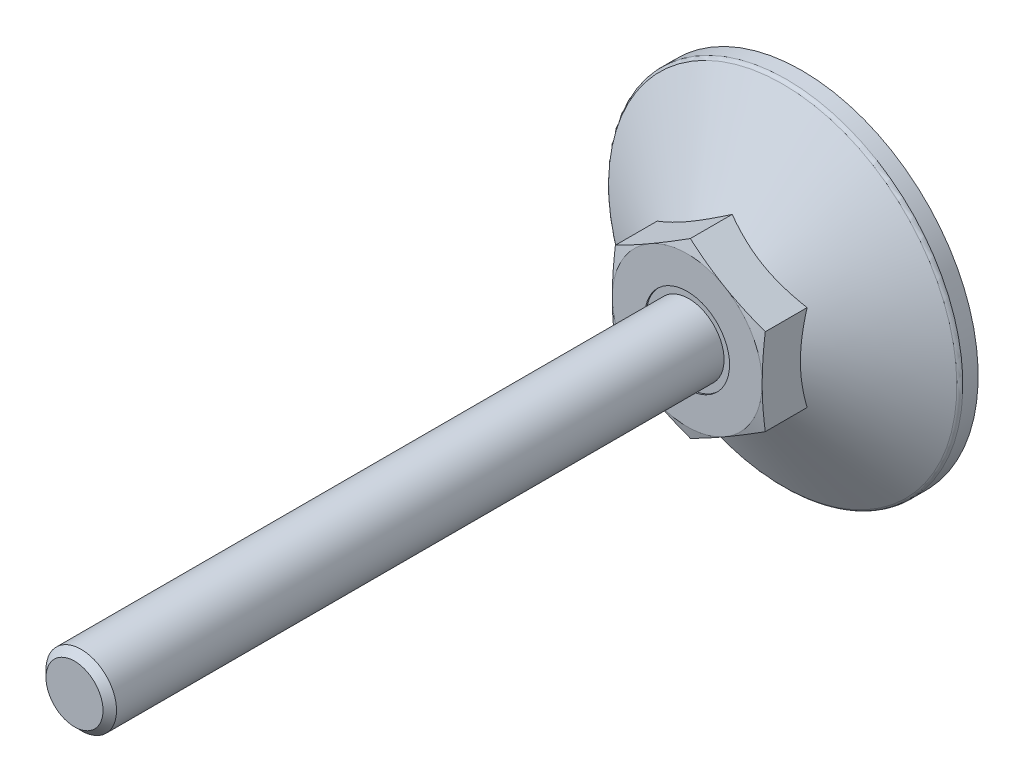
ISO-10303-21;
HEADER;
FILE_DESCRIPTION(('STEP AP214'),'2;1');
FILE_NAME('part.step','',(''),(''),'','','');
FILE_SCHEMA(('AUTOMOTIVE_DESIGN { 1 0 10303 214 1 1 1 1 }'));
ENDSEC;
DATA;
#1=APPLICATION_CONTEXT('core data for automotive mechanical design processes');
#2=APPLICATION_PROTOCOL_DEFINITION('international standard','automotive_design',2000,#1);
#3=PRODUCT_CONTEXT('',#1,'mechanical');
#4=PRODUCT('Part','Part','',(#3));
#5=PRODUCT_RELATED_PRODUCT_CATEGORY('part','',(#4));
#6=PRODUCT_DEFINITION_FORMATION('','',#4);
#7=PRODUCT_DEFINITION_CONTEXT('part definition',#1,'design');
#8=PRODUCT_DEFINITION('design','',#6,#7);
#9=PRODUCT_DEFINITION_SHAPE('','',#8);
#10=(LENGTH_UNIT() NAMED_UNIT(*) SI_UNIT(.MILLI.,.METRE.));
#11=(NAMED_UNIT(*) PLANE_ANGLE_UNIT() SI_UNIT($,.RADIAN.));
#12=(NAMED_UNIT(*) SI_UNIT($,.STERADIAN.) SOLID_ANGLE_UNIT());
#13=UNCERTAINTY_MEASURE_WITH_UNIT(LENGTH_MEASURE(1.E-05),#10,'distance_accuracy_value','');
#14=(GEOMETRIC_REPRESENTATION_CONTEXT(3) GLOBAL_UNCERTAINTY_ASSIGNED_CONTEXT((#13)) GLOBAL_UNIT_ASSIGNED_CONTEXT((#10,
#11,#12)) REPRESENTATION_CONTEXT('',''));
#15=CARTESIAN_POINT('',(0.,0.,0.));
#16=DIRECTION('',(0.,0.,1.));
#17=DIRECTION('',(1.,0.,0.));
#18=AXIS2_PLACEMENT_3D('',#15,#16,#17);
#19=CARTESIAN_POINT('',(0.,9.8149545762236,27.));
#20=DIRECTION('',(0.5,-0.86602540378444,0.));
#21=DIRECTION('',(0.86602540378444,0.5,0.));
#22=AXIS2_PLACEMENT_3D('',#19,#20,#21);
#23=PLANE('',#22);
#24=CARTESIAN_POINT('',(0.0002,9.81507004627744,12.6476280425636));
#25=CARTESIAN_POINT('',(-0.352800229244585,9.61126526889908,12.7022599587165));
#26=CARTESIAN_POINT('',(-0.706440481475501,9.40709097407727,12.7518566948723));
#27=CARTESIAN_POINT('',(-1.41496987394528,8.99802133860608,12.8389934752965));
#28=CARTESIAN_POINT('',(-1.76985946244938,8.79312573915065,12.8765286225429));
#29=CARTESIAN_POINT('',(-2.47873586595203,8.38385575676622,12.9373509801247));
#30=CARTESIAN_POINT('',(-2.83271788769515,8.17948414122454,12.9607107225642));
#31=CARTESIAN_POINT('',(-3.5411333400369,7.77048028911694,12.9920337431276));
#32=CARTESIAN_POINT('',(-3.89556667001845,7.56584811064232,13.));
#33=CARTESIAN_POINT('',(-4.60443332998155,7.15658375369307,13.));
#34=CARTESIAN_POINT('',(-4.9588666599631,6.95195157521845,12.9920337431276));
#35=CARTESIAN_POINT('',(-5.66728211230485,6.54294772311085,12.9607107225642));
#36=CARTESIAN_POINT('',(-6.02126413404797,6.33857610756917,12.9373509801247));
#37=CARTESIAN_POINT('',(-6.73014053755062,5.92930612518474,12.8765286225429));
#38=CARTESIAN_POINT('',(-7.08503012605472,5.7244105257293,12.8389934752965));
#39=CARTESIAN_POINT('',(-7.7935595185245,5.31534089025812,12.7518566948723));
#40=CARTESIAN_POINT('',(-8.14719977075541,5.11116659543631,12.7022599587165));
#41=CARTESIAN_POINT('',(-8.5002,4.90736181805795,12.6476280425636));
#42=B_SPLINE_CURVE_WITH_KNOTS('',3,(#24,#25,#26,#27,#28,#29,#30,#31,#32,#33,#34,#35,#36,#37,#38,
#39,#40,#41),.UNSPECIFIED.,.F.,.F.,(4,2,2,2,2,2,2,2,4),(0.,1.23382789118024,2.46815608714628,
3.69611406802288,4.92383440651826,6.15155474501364,7.37951272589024,8.61384092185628,
9.84766881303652),.UNSPECIFIED.);
#43=CARTESIAN_POINT('',(0.,9.8149545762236,12.6476589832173));
#44=VERTEX_POINT('',#43);
#45=CARTESIAN_POINT('',(-4.25,7.36121593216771,13.));
#46=VERTEX_POINT('',#45);
#47=EDGE_CURVE('E269',#44,#46,#42,.T.);
#48=ORIENTED_EDGE('',*,*,#47,.F.);
#49=DIRECTION('',(0.,0.,-1.));
#50=VECTOR('',#49,1.);
#51=CARTESIAN_POINT('',(0.,9.8149545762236,27.));
#52=LINE('',#51,#50);
#53=CARTESIAN_POINT('',(0.,9.8149545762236,7.90533871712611));
#54=VERTEX_POINT('',#53);
#55=EDGE_CURVE('E43',#44,#54,#52,.T.);
#56=ORIENTED_EDGE('',*,*,#55,.T.);
#57=CARTESIAN_POINT('',(-8.5002,4.90736181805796,7.90527204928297));
#58=CARTESIAN_POINT('',(-8.31336077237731,5.0152334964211,7.96754195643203));
#59=CARTESIAN_POINT('',(-8.1258249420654,5.12350735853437,8.02698579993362));
#60=CARTESIAN_POINT('',(-7.74923024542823,5.34093440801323,8.13944298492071));
#61=CARTESIAN_POINT('',(-7.56017075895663,5.45008795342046,8.19245355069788));
#62=CARTESIAN_POINT('',(-6.98996524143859,5.77929626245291,8.34079470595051));
#63=CARTESIAN_POINT('',(-6.60656835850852,6.00065055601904,8.42516916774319));
#64=CARTESIAN_POINT('',(-6.03282233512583,6.33190297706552,8.52410807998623));
#65=CARTESIAN_POINT('',(-5.8441872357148,6.44081150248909,8.55229289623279));
#66=CARTESIAN_POINT('',(-5.46606397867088,6.65912106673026,8.59955401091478));
#67=CARTESIAN_POINT('',(-5.27657589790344,6.76852206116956,8.61863111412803));
#68=CARTESIAN_POINT('',(-4.89727347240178,6.98751241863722,8.64719332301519));
#69=CARTESIAN_POINT('',(-4.70745974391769,7.0971014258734,8.65668931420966));
#70=CARTESIAN_POINT('',(-4.3276569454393,7.31638067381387,8.66588571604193));
#71=CARTESIAN_POINT('',(-4.13766788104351,7.42607091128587,8.66558642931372));
#72=CARTESIAN_POINT('',(-3.78247698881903,7.63114046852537,8.65587362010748));
#73=CARTESIAN_POINT('',(-3.61725009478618,7.7265342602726,8.64764492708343));
#74=CARTESIAN_POINT('',(-3.28718328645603,7.91709842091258,8.62393885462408));
#75=CARTESIAN_POINT('',(-3.12234339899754,8.01226877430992,8.60846098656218));
#76=CARTESIAN_POINT('',(-2.62846189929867,8.29741139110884,8.55151947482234));
#77=CARTESIAN_POINT('',(-2.30029449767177,8.48687892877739,8.49955503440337));
#78=CARTESIAN_POINT('',(-1.64047857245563,8.86782383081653,8.36964315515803));
#79=CARTESIAN_POINT('',(-1.30891425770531,9.0592525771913,8.29114502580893));
#80=CARTESIAN_POINT('',(-0.650730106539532,9.43925537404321,8.11298675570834));
#81=CARTESIAN_POINT('',(-0.324101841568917,9.62783429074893,8.01336845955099));
#82=CARTESIAN_POINT('',(0.000199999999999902,9.81507004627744,7.90527204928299));
#83=B_SPLINE_CURVE_WITH_KNOTS('',3,(#57,#58,#59,#60,#61,#62,#63,#64,#65,#66,#67,#68,#69,#70,#71,
#72,#73,#74,#75,#76,#77,#78,#79,#80,#81,#82),.UNSPECIFIED.,.F.,.F.,(4,2,2,2,2,2,2,2,2,2,2,2,4),
(0.,0.673596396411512,1.34748239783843,2.69805431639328,3.35679995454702,4.01548737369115,
4.67342558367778,5.33134346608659,5.90409556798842,6.47688628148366,7.62328361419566,
8.79510569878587,9.96462743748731),.UNSPECIFIED.);
#84=CARTESIAN_POINT('',(-8.5,4.9074772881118,7.90533871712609));
#85=VERTEX_POINT('',#84);
#86=EDGE_CURVE('E237',#85,#54,#83,.T.);
#87=ORIENTED_EDGE('',*,*,#86,.F.);
#88=DIRECTION('',(0.,0.,-1.));
#89=VECTOR('',#88,1.);
#90=CARTESIAN_POINT('',(-8.5,4.9074772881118,27.));
#91=LINE('',#90,#89);
#92=CARTESIAN_POINT('',(-8.5,4.9074772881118,12.6476589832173));
#93=VERTEX_POINT('',#92);
#94=EDGE_CURVE('E282',#93,#85,#91,.T.);
#95=ORIENTED_EDGE('',*,*,#94,.F.);
#96=EDGE_CURVE('E169',#46,#93,#42,.T.);
#97=ORIENTED_EDGE('',*,*,#96,.F.);
#98=EDGE_LOOP('',(#48,#56,#87,#95,#97));
#99=FACE_BOUND('',#98,.T.);
#100=ADVANCED_FACE('F14',(#99),#23,.F.);
#101=CARTESIAN_POINT('',(8.5,4.9074772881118,27.));
#102=DIRECTION('',(-0.5,-0.86602540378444,0.));
#103=DIRECTION('',(0.86602540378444,-0.5,0.));
#104=AXIS2_PLACEMENT_3D('',#101,#102,#103);
#105=PLANE('',#104);
#106=CARTESIAN_POINT('',(8.5002,4.90736181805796,12.6476280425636));
#107=CARTESIAN_POINT('',(8.14719977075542,5.11116659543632,12.7022599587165));
#108=CARTESIAN_POINT('',(7.7935595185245,5.31534089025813,12.7518566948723));
#109=CARTESIAN_POINT('',(7.08503012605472,5.72441052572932,12.8389934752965));
#110=CARTESIAN_POINT('',(6.73014053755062,5.92930612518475,12.8765286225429));
#111=CARTESIAN_POINT('',(6.02126413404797,6.33857610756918,12.9373509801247));
#112=CARTESIAN_POINT('',(5.66728211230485,6.54294772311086,12.9607107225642));
#113=CARTESIAN_POINT('',(4.9588666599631,6.95195157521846,12.9920337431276));
#114=CARTESIAN_POINT('',(4.60443332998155,7.15658375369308,13.));
#115=CARTESIAN_POINT('',(3.89556667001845,7.56584811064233,13.));
#116=CARTESIAN_POINT('',(3.5411333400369,7.77048028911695,12.9920337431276));
#117=CARTESIAN_POINT('',(2.83271788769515,8.17948414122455,12.9607107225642));
#118=CARTESIAN_POINT('',(2.47873586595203,8.38385575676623,12.9373509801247));
#119=CARTESIAN_POINT('',(1.76985946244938,8.79312573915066,12.8765286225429));
#120=CARTESIAN_POINT('',(1.41496987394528,8.9980213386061,12.8389934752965));
#121=CARTESIAN_POINT('',(0.706440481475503,9.40709097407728,12.7518566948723));
#122=CARTESIAN_POINT('',(0.352800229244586,9.61126526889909,12.7022599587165));
#123=CARTESIAN_POINT('',(-0.000200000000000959,9.81507004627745,12.6476280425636));
#124=B_SPLINE_CURVE_WITH_KNOTS('',3,(#106,#107,#108,#109,#110,#111,#112,#113,#114,#115,#116,
#117,#118,#119,#120,#121,#122,#123),.UNSPECIFIED.,.F.,.F.,(4,2,2,2,2,2,2,2,4),(0.,
1.23382789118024,2.46815608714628,3.69611406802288,4.92383440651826,6.15155474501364,
7.37951272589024,8.61384092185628,9.84766881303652),.UNSPECIFIED.);
#125=CARTESIAN_POINT('',(8.5,4.9074772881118,12.6476589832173));
#126=VERTEX_POINT('',#125);
#127=CARTESIAN_POINT('',(4.25,7.36121593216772,13.));
#128=VERTEX_POINT('',#127);
#129=EDGE_CURVE('E121',#126,#128,#124,.T.);
#130=ORIENTED_EDGE('',*,*,#129,.F.);
#131=DIRECTION('',(0.,0.,-1.));
#132=VECTOR('',#131,1.);
#133=CARTESIAN_POINT('',(8.5,4.9074772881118,27.));
#134=LINE('',#133,#132);
#135=CARTESIAN_POINT('',(8.5,4.9074772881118,7.90533871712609));
#136=VERTEX_POINT('',#135);
#137=EDGE_CURVE('E128',#126,#136,#134,.T.);
#138=ORIENTED_EDGE('',*,*,#137,.T.);
#139=CARTESIAN_POINT('',(-0.0002,9.81507004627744,7.90527204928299));
#140=CARTESIAN_POINT('',(0.186639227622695,9.7071983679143,7.96754195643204));
#141=CARTESIAN_POINT('',(0.374175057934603,9.59892450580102,8.02698579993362));
#142=CARTESIAN_POINT('',(0.750769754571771,9.38149745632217,8.13944298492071));
#143=CARTESIAN_POINT('',(0.939829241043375,9.27234391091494,8.19245355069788));
#144=CARTESIAN_POINT('',(1.51003475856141,8.94313560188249,8.34079470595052));
#145=CARTESIAN_POINT('',(1.89343164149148,8.72178130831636,8.42516916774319));
#146=CARTESIAN_POINT('',(2.46717766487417,8.39052888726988,8.52410807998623));
#147=CARTESIAN_POINT('',(2.6558127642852,8.28162036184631,8.55229289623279));
#148=CARTESIAN_POINT('',(3.03393602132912,8.06331079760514,8.59955401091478));
#149=CARTESIAN_POINT('',(3.22342410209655,7.95390980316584,8.61863111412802));
#150=CARTESIAN_POINT('',(3.60272652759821,7.73491944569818,8.64719332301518));
#151=CARTESIAN_POINT('',(3.79254025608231,7.62533043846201,8.65668931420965));
#152=CARTESIAN_POINT('',(4.1723430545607,7.40605119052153,8.66588571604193));
#153=CARTESIAN_POINT('',(4.36233211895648,7.29636095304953,8.66558642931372));
#154=CARTESIAN_POINT('',(4.71752301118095,7.09129139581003,8.65587362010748));
#155=CARTESIAN_POINT('',(4.88274990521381,6.9958976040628,8.64764492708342));
#156=CARTESIAN_POINT('',(5.21281671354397,6.80533344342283,8.62393885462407));
#157=CARTESIAN_POINT('',(5.37765660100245,6.71016309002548,8.60846098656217));
#158=CARTESIAN_POINT('',(5.87153810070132,6.42502047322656,8.55151947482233));
#159=CARTESIAN_POINT('',(6.19970550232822,6.23555293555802,8.49955503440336));
#160=CARTESIAN_POINT('',(6.85952142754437,5.85460803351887,8.36964315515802));
#161=CARTESIAN_POINT('',(7.19108574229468,5.6631792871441,8.29114502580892));
#162=CARTESIAN_POINT('',(7.84926989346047,5.28317649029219,8.11298675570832));
#163=CARTESIAN_POINT('',(8.17589815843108,5.09459757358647,8.01336845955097));
#164=CARTESIAN_POINT('',(8.5002,4.90736181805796,7.90527204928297));
#165=B_SPLINE_CURVE_WITH_KNOTS('',3,(#139,#140,#141,#142,#143,#144,#145,#146,#147,#148,#149,
#150,#151,#152,#153,#154,#155,#156,#157,#158,#159,#160,#161,#162,#163,#164),.UNSPECIFIED.,.F.,
.F.,(4,2,2,2,2,2,2,2,2,2,2,2,4),(0.,0.673596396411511,1.34748239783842,2.69805431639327,
3.35679995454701,4.01548737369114,4.67342558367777,5.33134346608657,5.90409556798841,
6.47688628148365,7.62328361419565,8.79510569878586,9.96462743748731),.UNSPECIFIED.);
#166=EDGE_CURVE('E231',#54,#136,#165,.T.);
#167=ORIENTED_EDGE('',*,*,#166,.F.);
#168=ORIENTED_EDGE('',*,*,#55,.F.);
#169=EDGE_CURVE('E138',#128,#44,#124,.T.);
#170=ORIENTED_EDGE('',*,*,#169,.F.);
#171=EDGE_LOOP('',(#130,#138,#167,#168,#170));
#172=FACE_BOUND('',#171,.T.);
#173=ADVANCED_FACE('F243',(#172),#105,.F.);
#174=CARTESIAN_POINT('',(8.5,-4.9074772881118,27.));
#175=DIRECTION('',(-1.,0.,0.));
#176=DIRECTION('',(0.,-1.,0.));
#177=AXIS2_PLACEMENT_3D('',#174,#175,#176);
#178=PLANE('',#177);
#179=CARTESIAN_POINT('',(8.5,-12.9948391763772,11.116878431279));
#180=CARTESIAN_POINT('',(8.5,-12.6090731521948,11.2033588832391));
#181=CARTESIAN_POINT('',(8.5,-12.2230661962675,11.2887838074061));
#182=CARTESIAN_POINT('',(8.5,-11.4504520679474,11.4569528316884));
#183=CARTESIAN_POINT('',(8.5,-11.0638448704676,11.5396968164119));
#184=CARTESIAN_POINT('',(8.5,-10.2895673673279,11.7020058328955));
#185=CARTESIAN_POINT('',(8.5,-9.90189639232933,11.7815676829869));
#186=CARTESIAN_POINT('',(8.5,-9.12574846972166,11.9366556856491));
#187=CARTESIAN_POINT('',(8.5,-8.7372715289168,12.0121818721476));
#188=CARTESIAN_POINT('',(8.5,-7.9624668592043,12.1576556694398));
#189=CARTESIAN_POINT('',(8.5,-7.57614659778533,12.2276428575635));
#190=CARTESIAN_POINT('',(8.5,-6.80245301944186,12.3615209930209));
#191=CARTESIAN_POINT('',(8.5,-6.41507972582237,12.4254120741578));
#192=CARTESIAN_POINT('',(8.5,-5.63920336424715,12.5456621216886));
#193=CARTESIAN_POINT('',(8.5,-5.25070043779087,12.6020219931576));
#194=CARTESIAN_POINT('',(8.5,-4.47245787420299,12.7055511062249));
#195=CARTESIAN_POINT('',(8.5,-4.08271823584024,12.7527203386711));
#196=CARTESIAN_POINT('',(8.5,-3.29759997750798,12.8365352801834));
#197=CARTESIAN_POINT('',(8.5,-2.9022077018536,12.8730549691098));
#198=CARTESIAN_POINT('',(8.5,-2.1104263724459,12.9330531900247));
#199=CARTESIAN_POINT('',(8.5,-1.71403734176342,12.9565320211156));
#200=CARTESIAN_POINT('',(8.5,-0.920837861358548,12.9890792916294));
#201=CARTESIAN_POINT('',(8.5,-0.524027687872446,12.9981543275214));
#202=CARTESIAN_POINT('',(8.5,0.269653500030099,13.0013357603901));
#203=CARTESIAN_POINT('',(8.5,0.666524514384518,12.9954421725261));
#204=CARTESIAN_POINT('',(8.5,1.46121432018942,12.9690176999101));
#205=CARTESIAN_POINT('',(8.5,1.85903130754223,12.9484336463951));
#206=CARTESIAN_POINT('',(8.5,2.65373139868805,12.893804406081));
#207=CARTESIAN_POINT('',(8.5,3.05061448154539,12.8597589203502));
#208=CARTESIAN_POINT('',(8.5,3.84344310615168,12.7799297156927));
#209=CARTESIAN_POINT('',(8.5,4.23938786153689,12.7341383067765));
#210=CARTESIAN_POINT('',(8.5,5.03000262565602,12.6327265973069));
#211=CARTESIAN_POINT('',(8.5,5.42467263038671,12.5771062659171));
#212=CARTESIAN_POINT('',(8.5,6.18755405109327,12.4616375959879));
#213=CARTESIAN_POINT('',(8.5,6.55584171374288,12.4022879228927));
#214=CARTESIAN_POINT('',(8.5,7.29144356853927,12.2778075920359));
#215=CARTESIAN_POINT('',(8.5,7.65875773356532,12.2126767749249));
#216=CARTESIAN_POINT('',(8.5,8.39254741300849,12.0776927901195));
#217=CARTESIAN_POINT('',(8.5,8.75902284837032,12.0078391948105));
#218=CARTESIAN_POINT('',(8.5,9.4912206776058,11.864280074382));
#219=CARTESIAN_POINT('',(8.5,9.85694306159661,11.790574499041));
#220=CARTESIAN_POINT('',(8.5,10.5878202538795,11.6399930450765));
#221=CARTESIAN_POINT('',(8.5,10.9529749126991,11.5631164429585));
#222=CARTESIAN_POINT('',(8.5,11.6827276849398,11.4067618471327));
#223=CARTESIAN_POINT('',(8.5,12.047325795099,11.3272838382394));
#224=CARTESIAN_POINT('',(8.5,13.1403605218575,11.085651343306));
#225=CARTESIAN_POINT('',(8.5,13.8680874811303,10.9202879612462));
#226=CARTESIAN_POINT('',(8.5,15.3149989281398,10.5852535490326));
#227=CARTESIAN_POINT('',(8.5,16.0341970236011,10.4156409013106));
#228=CARTESIAN_POINT('',(8.5,17.4715910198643,10.072170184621));
#229=CARTESIAN_POINT('',(8.5,18.1897869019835,9.89831203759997));
#230=CARTESIAN_POINT('',(8.5,19.6245193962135,9.54768250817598));
#231=CARTESIAN_POINT('',(8.5,20.3410569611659,9.37091501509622));
#232=CARTESIAN_POINT('',(8.5,21.7735087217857,9.01497115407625));
#233=CARTESIAN_POINT('',(8.5,22.4894229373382,8.83579486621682));
#234=CARTESIAN_POINT('',(8.5,23.205120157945,8.65576558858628));
#235=B_SPLINE_CURVE_WITH_KNOTS('',3,(#179,#180,#181,#182,#183,#184,#185,#186,#187,#188,#189,
#190,#191,#192,#193,#194,#195,#196,#197,#198,#199,#200,#201,#202,#203,#204,#205,#206,#207,#208,
#209,#210,#211,#212,#213,#214,#215,#216,#217,#218,#219,#220,#221,#222,#223,#224,#225,#226,#227,
#228,#229,#230,#231,#232,#233,#234),.UNSPECIFIED.,.F.,.F.,(4,2,2,2,2,2,2,2,2,2,2,2,2,2,2,2,2,2,
2,2,2,2,2,2,2,2,2,4),(0.,1.18602700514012,2.37210499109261,3.55934065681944,4.74656633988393,
5.92435328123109,7.1021143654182,8.2797337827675,9.45735437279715,10.648391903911,
11.8394021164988,13.0298667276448,14.2203301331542,15.4151241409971,16.6099446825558,
17.8055494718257,19.0011580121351,20.1202210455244,21.2393149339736,22.3585102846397,
23.4777202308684,24.5971869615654,25.716660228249,27.9554537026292,30.1722222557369,
32.3890315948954,34.6030857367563,36.8170664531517),.UNSPECIFIED.);
#236=CARTESIAN_POINT('',(8.5,-4.90747728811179,12.6476589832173));
#237=VERTEX_POINT('',#236);
#238=CARTESIAN_POINT('',(8.5,0.,13.));
#239=VERTEX_POINT('',#238);
#240=EDGE_CURVE('E95',#237,#239,#235,.T.);
#241=ORIENTED_EDGE('',*,*,#240,.F.);
#242=DIRECTION('',(0.,0.,-1.));
#243=VECTOR('',#242,1.);
#244=CARTESIAN_POINT('',(8.5,-4.9074772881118,27.));
#245=LINE('',#244,#243);
#246=CARTESIAN_POINT('',(8.5,-4.9074772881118,7.90533871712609));
#247=VERTEX_POINT('',#246);
#248=EDGE_CURVE('E275',#237,#247,#245,.T.);
#249=ORIENTED_EDGE('',*,*,#248,.T.);
#250=CARTESIAN_POINT('',(8.5,12.7492767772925,4.72527230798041));
#251=CARTESIAN_POINT('',(8.5,12.3811478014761,4.90206026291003));
#252=CARTESIAN_POINT('',(8.5,12.0121249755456,5.07702151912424));
#253=CARTESIAN_POINT('',(8.5,11.2718137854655,5.42225230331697));
#254=CARTESIAN_POINT('',(8.5,10.9005250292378,5.59252098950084));
#255=CARTESIAN_POINT('',(8.5,10.1530767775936,5.92827896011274));
#256=CARTESIAN_POINT('',(8.5,9.77690140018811,6.09373302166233));
#257=CARTESIAN_POINT('',(8.5,9.02139912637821,6.41725455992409));
#258=CARTESIAN_POINT('',(8.5,8.64207239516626,6.57532242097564));
#259=CARTESIAN_POINT('',(8.5,7.86979942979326,6.88607334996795));
#260=CARTESIAN_POINT('',(8.5,7.47675434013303,7.03851219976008));
#261=CARTESIAN_POINT('',(8.5,6.68591204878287,7.33076935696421));
#262=CARTESIAN_POINT('',(8.5,6.28811429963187,7.47058619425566));
#263=CARTESIAN_POINT('',(8.5,5.48802263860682,7.733611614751));
#264=CARTESIAN_POINT('',(8.5,5.08574124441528,7.85685783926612));
#265=CARTESIAN_POINT('',(8.5,4.27544970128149,8.08251258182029));
#266=CARTESIAN_POINT('',(8.5,3.86744153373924,8.18492812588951));
#267=CARTESIAN_POINT('',(8.5,3.04728386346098,8.36327495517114));
#268=CARTESIAN_POINT('',(8.5,2.6351585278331,8.43931422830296));
#269=CARTESIAN_POINT('',(8.5,2.01359122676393,8.53003978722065));
#270=CARTESIAN_POINT('',(8.5,1.80582110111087,8.55639399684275));
#271=CARTESIAN_POINT('',(8.5,1.38940213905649,8.60080126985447));
#272=CARTESIAN_POINT('',(8.5,1.18075338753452,8.61885511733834));
#273=CARTESIAN_POINT('',(8.5,0.765376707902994,8.64609671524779));
#274=CARTESIAN_POINT('',(8.5,0.558655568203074,8.65538769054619));
#275=CARTESIAN_POINT('',(8.5,0.1450067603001,8.66526416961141));
#276=CARTESIAN_POINT('',(8.5,-0.0619209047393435,8.6658498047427));
#277=CARTESIAN_POINT('',(8.5,-0.475626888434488,8.65830085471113));
#278=CARTESIAN_POINT('',(8.5,-0.682405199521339,8.65016585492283));
#279=CARTESIAN_POINT('',(8.5,-1.09545270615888,8.625363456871));
#280=CARTESIAN_POINT('',(8.5,-1.30172187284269,8.60869558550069));
#281=CARTESIAN_POINT('',(8.5,-1.81090940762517,8.55735076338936));
#282=CARTESIAN_POINT('',(8.5,-2.11335210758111,8.51788364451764));
#283=CARTESIAN_POINT('',(8.5,-2.71570235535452,8.4228634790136));
#284=CARTESIAN_POINT('',(8.5,-3.01560949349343,8.36730788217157));
#285=CARTESIAN_POINT('',(8.5,-3.61268959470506,8.2420877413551));
#286=CARTESIAN_POINT('',(8.5,-3.90986014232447,8.17241178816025));
#287=CARTESIAN_POINT('',(8.5,-4.50108875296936,8.02104250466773));
#288=CARTESIAN_POINT('',(8.5,-4.79514688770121,7.93934945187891));
#289=CARTESIAN_POINT('',(8.5,-5.3871494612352,7.7638116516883));
#290=CARTESIAN_POINT('',(8.5,-5.68502188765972,7.6697256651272));
#291=CARTESIAN_POINT('',(8.5,-6.27782977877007,7.4727599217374));
#292=CARTESIAN_POINT('',(8.5,-6.57276522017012,7.36988009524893));
#293=CARTESIAN_POINT('',(8.5,-7.15987047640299,7.15687683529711));
#294=CARTESIAN_POINT('',(8.5,-7.45204129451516,7.04675615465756));
#295=CARTESIAN_POINT('',(8.5,-8.03401937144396,6.82048197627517));
#296=CARTESIAN_POINT('',(8.5,-8.32382669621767,6.70432864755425));
#297=CARTESIAN_POINT('',(8.5,-8.8985343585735,6.468166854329));
#298=CARTESIAN_POINT('',(8.5,-9.18345493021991,6.34820749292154));
#299=CARTESIAN_POINT('',(8.5,-9.75152375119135,6.10415692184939));
#300=CARTESIAN_POINT('',(8.5,-10.034671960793,5.98006561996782));
#301=CARTESIAN_POINT('',(8.5,-10.8818575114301,5.60257794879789));
#302=CARTESIAN_POINT('',(8.5,-11.4435817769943,5.34399030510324));
#303=CARTESIAN_POINT('',(8.5,-12.5625477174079,4.81675169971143));
#304=CARTESIAN_POINT('',(8.5,-13.1197873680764,4.54809647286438));
#305=CARTESIAN_POINT('',(8.5,-14.2306052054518,4.00340707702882));
#306=CARTESIAN_POINT('',(8.5,-14.7841835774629,3.72737328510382));
#307=CARTESIAN_POINT('',(8.5,-15.8894273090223,3.16924748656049));
#308=CARTESIAN_POINT('',(8.5,-16.4410879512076,2.88714616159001));
#309=CARTESIAN_POINT('',(8.5,-17.5421722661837,2.31860293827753));
#310=CARTESIAN_POINT('',(8.5,-18.0915959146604,2.03216099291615));
#311=CARTESIAN_POINT('',(8.5,-19.1885131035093,1.45593769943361));
#312=CARTESIAN_POINT('',(8.5,-19.7360070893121,1.1661571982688));
#313=CARTESIAN_POINT('',(8.5,-20.8295421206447,0.583866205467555));
#314=CARTESIAN_POINT('',(8.5,-21.3755831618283,0.291355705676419));
#315=CARTESIAN_POINT('',(8.5,-22.8810608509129,-0.519031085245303));
#316=CARTESIAN_POINT('',(8.5,-23.8392547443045,-1.03921546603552));
#317=CARTESIAN_POINT('',(8.5,-25.7530641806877,-2.08445783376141));
#318=CARTESIAN_POINT('',(8.5,-26.708679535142,-2.60951616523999));
#319=CARTESIAN_POINT('',(8.5,-28.6148788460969,-3.66152013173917));
#320=CARTESIAN_POINT('',(8.5,-29.565469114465,-4.18845433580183));
#321=CARTESIAN_POINT('',(8.5,-30.9901906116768,-4.98085413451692));
#322=CARTESIAN_POINT('',(8.5,-31.4648842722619,-5.24530955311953));
#323=CARTESIAN_POINT('',(8.5,-32.4139385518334,-5.77481644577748));
#324=CARTESIAN_POINT('',(8.5,-32.8882991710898,-6.03986791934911));
#325=CARTESIAN_POINT('',(8.5,-33.3625145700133,-6.30517901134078));
#326=B_SPLINE_CURVE_WITH_KNOTS('',3,(#250,#251,#252,#253,#254,#255,#256,#257,#258,#259,#260,
#261,#262,#263,#264,#265,#266,#267,#268,#269,#270,#271,#272,#273,#274,#275,#276,#277,#278,#279,
#280,#281,#282,#283,#284,#285,#286,#287,#288,#289,#290,#291,#292,#293,#294,#295,#296,#297,#298,
#299,#300,#301,#302,#303,#304,#305,#306,#307,#308,#309,#310,#311,#312,#313,#314,#315,#316,#317,
#318,#319,#320,#321,#322,#323,#324,#325),.UNSPECIFIED.,.F.,.F.,(4,2,2,2,2,2,2,2,2,2,2,2,2,2,2,2,
2,2,2,2,2,2,2,2,2,2,2,2,2,2,2,2,2,2,2,2,2,4),(0.,1.22515253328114,2.45052343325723,
3.6833213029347,4.91605495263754,6.18059988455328,7.44529191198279,8.70706073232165,
9.96840325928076,11.2245189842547,11.852683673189,12.4807890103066,13.1013994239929,
13.7220004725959,14.3426310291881,14.9632960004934,15.8778021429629,16.7924533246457,
17.7078465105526,18.6232185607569,19.5601888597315,20.4971665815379,21.433790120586,
22.3703874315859,23.297780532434,24.225194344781,26.0801973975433,27.9359954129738,
29.7916987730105,31.6504906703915,33.5093027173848,35.3676531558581,37.2260091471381,
40.4968499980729,43.7679238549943,47.0285209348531,48.6586852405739,50.2888482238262),.UNSPECIFIED.);
#327=EDGE_CURVE('E197',#136,#247,#326,.T.);
#328=ORIENTED_EDGE('',*,*,#327,.F.);
#329=ORIENTED_EDGE('',*,*,#137,.F.);
#330=EDGE_CURVE('E106',#239,#126,#235,.T.);
#331=ORIENTED_EDGE('',*,*,#330,.F.);
#332=EDGE_LOOP('',(#241,#249,#328,#329,#331));
#333=FACE_BOUND('',#332,.T.);
#334=ADVANCED_FACE('F126',(#333),#178,.F.);
#335=CARTESIAN_POINT('',(0.,-9.8149545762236,27.));
#336=DIRECTION('',(-0.5,0.86602540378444,0.));
#337=DIRECTION('',(-0.86602540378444,-0.5,0.));
#338=AXIS2_PLACEMENT_3D('',#335,#336,#337);
#339=PLANE('',#338);
#340=CARTESIAN_POINT('',(-0.0002,-9.81507004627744,12.6476280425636));
#341=CARTESIAN_POINT('',(0.352800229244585,-9.61126526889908,12.7022599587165));
#342=CARTESIAN_POINT('',(0.706440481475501,-9.40709097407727,12.7518566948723));
#343=CARTESIAN_POINT('',(1.41496987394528,-8.99802133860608,12.8389934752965));
#344=CARTESIAN_POINT('',(1.76985946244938,-8.79312573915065,12.8765286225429));
#345=CARTESIAN_POINT('',(2.47873586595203,-8.38385575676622,12.9373509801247));
#346=CARTESIAN_POINT('',(2.83271788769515,-8.17948414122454,12.9607107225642));
#347=CARTESIAN_POINT('',(3.5411333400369,-7.77048028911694,12.9920337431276));
#348=CARTESIAN_POINT('',(3.89556667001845,-7.56584811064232,13.));
#349=CARTESIAN_POINT('',(4.60443332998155,-7.15658375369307,13.));
#350=CARTESIAN_POINT('',(4.9588666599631,-6.95195157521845,12.9920337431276));
#351=CARTESIAN_POINT('',(5.66728211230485,-6.54294772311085,12.9607107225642));
#352=CARTESIAN_POINT('',(6.02126413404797,-6.33857610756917,12.9373509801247));
#353=CARTESIAN_POINT('',(6.73014053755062,-5.92930612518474,12.8765286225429));
#354=CARTESIAN_POINT('',(7.08503012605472,-5.7244105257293,12.8389934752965));
#355=CARTESIAN_POINT('',(7.7935595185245,-5.31534089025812,12.7518566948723));
#356=CARTESIAN_POINT('',(8.14719977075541,-5.11116659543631,12.7022599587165));
#357=CARTESIAN_POINT('',(8.5002,-4.90736181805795,12.6476280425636));
#358=B_SPLINE_CURVE_WITH_KNOTS('',3,(#340,#341,#342,#343,#344,#345,#346,#347,#348,#349,#350,
#351,#352,#353,#354,#355,#356,#357),.UNSPECIFIED.,.F.,.F.,(4,2,2,2,2,2,2,2,4),(0.,
1.23382789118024,2.46815608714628,3.69611406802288,4.92383440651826,6.15155474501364,
7.37951272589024,8.61384092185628,9.84766881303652),.UNSPECIFIED.);
#359=CARTESIAN_POINT('',(0.,-9.81495457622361,12.6476589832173));
#360=VERTEX_POINT('',#359);
#361=CARTESIAN_POINT('',(4.25,-7.36121593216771,13.));
#362=VERTEX_POINT('',#361);
#363=EDGE_CURVE('E130',#360,#362,#358,.T.);
#364=ORIENTED_EDGE('',*,*,#363,.F.);
#365=DIRECTION('',(0.,0.,-1.));
#366=VECTOR('',#365,1.);
#367=CARTESIAN_POINT('',(0.,-9.8149545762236,27.));
#368=LINE('',#367,#366);
#369=CARTESIAN_POINT('',(0.,-9.8149545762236,7.90533871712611));
#370=VERTEX_POINT('',#369);
#371=EDGE_CURVE('E279',#360,#370,#368,.T.);
#372=ORIENTED_EDGE('',*,*,#371,.T.);
#373=CARTESIAN_POINT('',(8.5002,-4.90736181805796,7.90527204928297));
#374=CARTESIAN_POINT('',(8.31336077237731,-5.0152334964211,7.96754195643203));
#375=CARTESIAN_POINT('',(8.1258249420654,-5.12350735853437,8.02698579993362));
#376=CARTESIAN_POINT('',(7.74923024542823,-5.34093440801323,8.13944298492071));
#377=CARTESIAN_POINT('',(7.56017075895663,-5.45008795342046,8.19245355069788));
#378=CARTESIAN_POINT('',(6.98996524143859,-5.77929626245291,8.34079470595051));
#379=CARTESIAN_POINT('',(6.60656835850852,-6.00065055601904,8.42516916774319));
#380=CARTESIAN_POINT('',(6.03282233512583,-6.33190297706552,8.52410807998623));
#381=CARTESIAN_POINT('',(5.8441872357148,-6.44081150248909,8.55229289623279));
#382=CARTESIAN_POINT('',(5.46606397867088,-6.65912106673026,8.59955401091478));
#383=CARTESIAN_POINT('',(5.27657589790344,-6.76852206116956,8.61863111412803));
#384=CARTESIAN_POINT('',(4.89727347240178,-6.98751241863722,8.64719332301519));
#385=CARTESIAN_POINT('',(4.70745974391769,-7.0971014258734,8.65668931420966));
#386=CARTESIAN_POINT('',(4.3276569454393,-7.31638067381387,8.66588571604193));
#387=CARTESIAN_POINT('',(4.13766788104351,-7.42607091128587,8.66558642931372));
#388=CARTESIAN_POINT('',(3.78247698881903,-7.63114046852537,8.65587362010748));
#389=CARTESIAN_POINT('',(3.61725009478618,-7.7265342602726,8.64764492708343));
#390=CARTESIAN_POINT('',(3.28718328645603,-7.91709842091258,8.62393885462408));
#391=CARTESIAN_POINT('',(3.12234339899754,-8.01226877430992,8.60846098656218));
#392=CARTESIAN_POINT('',(2.62846189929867,-8.29741139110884,8.55151947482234));
#393=CARTESIAN_POINT('',(2.30029449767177,-8.48687892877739,8.49955503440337));
#394=CARTESIAN_POINT('',(1.64047857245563,-8.86782383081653,8.36964315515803));
#395=CARTESIAN_POINT('',(1.30891425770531,-9.0592525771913,8.29114502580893));
#396=CARTESIAN_POINT('',(0.650730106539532,-9.43925537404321,8.11298675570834));
#397=CARTESIAN_POINT('',(0.324101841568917,-9.62783429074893,8.01336845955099));
#398=CARTESIAN_POINT('',(-0.000199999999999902,-9.81507004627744,7.90527204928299));
#399=B_SPLINE_CURVE_WITH_KNOTS('',3,(#373,#374,#375,#376,#377,#378,#379,#380,#381,#382,#383,
#384,#385,#386,#387,#388,#389,#390,#391,#392,#393,#394,#395,#396,#397,#398),.UNSPECIFIED.,.F.,
.F.,(4,2,2,2,2,2,2,2,2,2,2,2,4),(0.,0.673596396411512,1.34748239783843,2.69805431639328,
3.35679995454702,4.01548737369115,4.67342558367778,5.33134346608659,5.90409556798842,
6.47688628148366,7.62328361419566,8.79510569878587,9.96462743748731),.UNSPECIFIED.);
#400=EDGE_CURVE('E188',#247,#370,#399,.T.);
#401=ORIENTED_EDGE('',*,*,#400,.F.);
#402=ORIENTED_EDGE('',*,*,#248,.F.);
#403=EDGE_CURVE('E101',#362,#237,#358,.T.);
#404=ORIENTED_EDGE('',*,*,#403,.F.);
#405=EDGE_LOOP('',(#364,#372,#401,#402,#404));
#406=FACE_BOUND('',#405,.T.);
#407=ADVANCED_FACE('F180',(#406),#339,.F.);
#408=CARTESIAN_POINT('',(-8.5,-4.9074772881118,27.));
#409=DIRECTION('',(0.5,0.86602540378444,0.));
#410=DIRECTION('',(-0.86602540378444,0.5,0.));
#411=AXIS2_PLACEMENT_3D('',#408,#409,#410);
#412=PLANE('',#411);
#413=CARTESIAN_POINT('',(-8.5002,-4.90736181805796,12.6476280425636));
#414=CARTESIAN_POINT('',(-8.14719977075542,-5.11116659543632,12.7022599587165));
#415=CARTESIAN_POINT('',(-7.7935595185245,-5.31534089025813,12.7518566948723));
#416=CARTESIAN_POINT('',(-7.08503012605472,-5.72441052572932,12.8389934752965));
#417=CARTESIAN_POINT('',(-6.73014053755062,-5.92930612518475,12.8765286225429));
#418=CARTESIAN_POINT('',(-6.02126413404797,-6.33857610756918,12.9373509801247));
#419=CARTESIAN_POINT('',(-5.66728211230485,-6.54294772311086,12.9607107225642));
#420=CARTESIAN_POINT('',(-4.9588666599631,-6.95195157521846,12.9920337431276));
#421=CARTESIAN_POINT('',(-4.60443332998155,-7.15658375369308,13.));
#422=CARTESIAN_POINT('',(-3.89556667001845,-7.56584811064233,13.));
#423=CARTESIAN_POINT('',(-3.5411333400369,-7.77048028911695,12.9920337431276));
#424=CARTESIAN_POINT('',(-2.83271788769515,-8.17948414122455,12.9607107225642));
#425=CARTESIAN_POINT('',(-2.47873586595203,-8.38385575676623,12.9373509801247));
#426=CARTESIAN_POINT('',(-1.76985946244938,-8.79312573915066,12.8765286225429));
#427=CARTESIAN_POINT('',(-1.41496987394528,-8.9980213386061,12.8389934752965));
#428=CARTESIAN_POINT('',(-0.706440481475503,-9.40709097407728,12.7518566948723));
#429=CARTESIAN_POINT('',(-0.352800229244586,-9.61126526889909,12.7022599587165));
#430=CARTESIAN_POINT('',(0.000200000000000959,-9.81507004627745,12.6476280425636));
#431=B_SPLINE_CURVE_WITH_KNOTS('',3,(#413,#414,#415,#416,#417,#418,#419,#420,#421,#422,#423,
#424,#425,#426,#427,#428,#429,#430),.UNSPECIFIED.,.F.,.F.,(4,2,2,2,2,2,2,2,4),(0.,
1.23382789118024,2.46815608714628,3.69611406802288,4.92383440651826,6.15155474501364,
7.37951272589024,8.61384092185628,9.84766881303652),.UNSPECIFIED.);
#432=CARTESIAN_POINT('',(-8.5,-4.9074772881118,12.6476589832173));
#433=VERTEX_POINT('',#432);
#434=CARTESIAN_POINT('',(-4.25,-7.36121593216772,13.));
#435=VERTEX_POINT('',#434);
#436=EDGE_CURVE('E161',#433,#435,#431,.T.);
#437=ORIENTED_EDGE('',*,*,#436,.F.);
#438=DIRECTION('',(0.,0.,-1.));
#439=VECTOR('',#438,1.);
#440=CARTESIAN_POINT('',(-8.5,-4.9074772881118,27.));
#441=LINE('',#440,#439);
#442=CARTESIAN_POINT('',(-8.5,-4.9074772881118,7.90533871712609));
#443=VERTEX_POINT('',#442);
#444=EDGE_CURVE('E281',#433,#443,#441,.T.);
#445=ORIENTED_EDGE('',*,*,#444,.T.);
#446=CARTESIAN_POINT('',(0.0002,-9.81507004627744,7.90527204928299));
#447=CARTESIAN_POINT('',(-0.186639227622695,-9.7071983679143,7.96754195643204));
#448=CARTESIAN_POINT('',(-0.374175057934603,-9.59892450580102,8.02698579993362));
#449=CARTESIAN_POINT('',(-0.750769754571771,-9.38149745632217,8.13944298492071));
#450=CARTESIAN_POINT('',(-0.939829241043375,-9.27234391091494,8.19245355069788));
#451=CARTESIAN_POINT('',(-1.51003475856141,-8.94313560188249,8.34079470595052));
#452=CARTESIAN_POINT('',(-1.89343164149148,-8.72178130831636,8.42516916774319));
#453=CARTESIAN_POINT('',(-2.46717766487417,-8.39052888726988,8.52410807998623));
#454=CARTESIAN_POINT('',(-2.6558127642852,-8.28162036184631,8.55229289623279));
#455=CARTESIAN_POINT('',(-3.03393602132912,-8.06331079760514,8.59955401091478));
#456=CARTESIAN_POINT('',(-3.22342410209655,-7.95390980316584,8.61863111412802));
#457=CARTESIAN_POINT('',(-3.60272652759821,-7.73491944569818,8.64719332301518));
#458=CARTESIAN_POINT('',(-3.79254025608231,-7.62533043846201,8.65668931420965));
#459=CARTESIAN_POINT('',(-4.1723430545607,-7.40605119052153,8.66588571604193));
#460=CARTESIAN_POINT('',(-4.36233211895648,-7.29636095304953,8.66558642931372));
#461=CARTESIAN_POINT('',(-4.71752301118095,-7.09129139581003,8.65587362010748));
#462=CARTESIAN_POINT('',(-4.88274990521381,-6.9958976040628,8.64764492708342));
#463=CARTESIAN_POINT('',(-5.21281671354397,-6.80533344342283,8.62393885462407));
#464=CARTESIAN_POINT('',(-5.37765660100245,-6.71016309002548,8.60846098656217));
#465=CARTESIAN_POINT('',(-5.87153810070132,-6.42502047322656,8.55151947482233));
#466=CARTESIAN_POINT('',(-6.19970550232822,-6.23555293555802,8.49955503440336));
#467=CARTESIAN_POINT('',(-6.85952142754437,-5.85460803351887,8.36964315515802));
#468=CARTESIAN_POINT('',(-7.19108574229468,-5.6631792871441,8.29114502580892));
#469=CARTESIAN_POINT('',(-7.84926989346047,-5.28317649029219,8.11298675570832));
#470=CARTESIAN_POINT('',(-8.17589815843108,-5.09459757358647,8.01336845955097));
#471=CARTESIAN_POINT('',(-8.5002,-4.90736181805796,7.90527204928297));
#472=B_SPLINE_CURVE_WITH_KNOTS('',3,(#446,#447,#448,#449,#450,#451,#452,#453,#454,#455,#456,
#457,#458,#459,#460,#461,#462,#463,#464,#465,#466,#467,#468,#469,#470,#471),.UNSPECIFIED.,.F.,
.F.,(4,2,2,2,2,2,2,2,2,2,2,2,4),(0.,0.673596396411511,1.34748239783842,2.69805431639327,
3.35679995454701,4.01548737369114,4.67342558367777,5.33134346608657,5.90409556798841,
6.47688628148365,7.62328361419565,8.79510569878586,9.96462743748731),.UNSPECIFIED.);
#473=EDGE_CURVE('E198',#370,#443,#472,.T.);
#474=ORIENTED_EDGE('',*,*,#473,.F.);
#475=ORIENTED_EDGE('',*,*,#371,.F.);
#476=EDGE_CURVE('E179',#435,#360,#431,.T.);
#477=ORIENTED_EDGE('',*,*,#476,.F.);
#478=EDGE_LOOP('',(#437,#445,#474,#475,#477));
#479=FACE_BOUND('',#478,.T.);
#480=ADVANCED_FACE('F183',(#479),#412,.F.);
#481=CARTESIAN_POINT('',(-8.5,4.9074772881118,27.));
#482=DIRECTION('',(1.,0.,0.));
#483=DIRECTION('',(0.,1.,0.));
#484=AXIS2_PLACEMENT_3D('',#481,#482,#483);
#485=PLANE('',#484);
#486=CARTESIAN_POINT('',(-8.5,-12.9948391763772,11.116878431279));
#487=CARTESIAN_POINT('',(-8.5,-12.6090731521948,11.2033588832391));
#488=CARTESIAN_POINT('',(-8.5,-12.2230661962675,11.2887838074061));
#489=CARTESIAN_POINT('',(-8.5,-11.4504520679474,11.4569528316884));
#490=CARTESIAN_POINT('',(-8.5,-11.0638448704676,11.5396968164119));
#491=CARTESIAN_POINT('',(-8.5,-10.2895673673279,11.7020058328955));
#492=CARTESIAN_POINT('',(-8.5,-9.90189639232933,11.7815676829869));
#493=CARTESIAN_POINT('',(-8.5,-9.12574846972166,11.9366556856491));
#494=CARTESIAN_POINT('',(-8.5,-8.7372715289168,12.0121818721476));
#495=CARTESIAN_POINT('',(-8.5,-7.9624668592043,12.1576556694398));
#496=CARTESIAN_POINT('',(-8.5,-7.57614659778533,12.2276428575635));
#497=CARTESIAN_POINT('',(-8.5,-6.80245301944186,12.3615209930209));
#498=CARTESIAN_POINT('',(-8.5,-6.41507972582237,12.4254120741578));
#499=CARTESIAN_POINT('',(-8.5,-5.63920336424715,12.5456621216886));
#500=CARTESIAN_POINT('',(-8.5,-5.25070043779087,12.6020219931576));
#501=CARTESIAN_POINT('',(-8.5,-4.47245787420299,12.7055511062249));
#502=CARTESIAN_POINT('',(-8.5,-4.08271823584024,12.7527203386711));
#503=CARTESIAN_POINT('',(-8.5,-3.29759997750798,12.8365352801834));
#504=CARTESIAN_POINT('',(-8.5,-2.9022077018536,12.8730549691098));
#505=CARTESIAN_POINT('',(-8.5,-2.1104263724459,12.9330531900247));
#506=CARTESIAN_POINT('',(-8.5,-1.71403734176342,12.9565320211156));
#507=CARTESIAN_POINT('',(-8.5,-0.920837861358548,12.9890792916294));
#508=CARTESIAN_POINT('',(-8.5,-0.524027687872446,12.9981543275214));
#509=CARTESIAN_POINT('',(-8.5,0.269653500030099,13.0013357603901));
#510=CARTESIAN_POINT('',(-8.5,0.666524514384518,12.9954421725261));
#511=CARTESIAN_POINT('',(-8.5,1.46121432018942,12.9690176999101));
#512=CARTESIAN_POINT('',(-8.5,1.85903130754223,12.9484336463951));
#513=CARTESIAN_POINT('',(-8.5,2.65373139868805,12.893804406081));
#514=CARTESIAN_POINT('',(-8.5,3.05061448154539,12.8597589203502));
#515=CARTESIAN_POINT('',(-8.5,3.84344310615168,12.7799297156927));
#516=CARTESIAN_POINT('',(-8.5,4.23938786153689,12.7341383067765));
#517=CARTESIAN_POINT('',(-8.5,5.03000262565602,12.6327265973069));
#518=CARTESIAN_POINT('',(-8.5,5.42467263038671,12.5771062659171));
#519=CARTESIAN_POINT('',(-8.5,6.18755405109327,12.4616375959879));
#520=CARTESIAN_POINT('',(-8.5,6.55584171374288,12.4022879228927));
#521=CARTESIAN_POINT('',(-8.5,7.29144356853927,12.2778075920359));
#522=CARTESIAN_POINT('',(-8.5,7.65875773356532,12.2126767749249));
#523=CARTESIAN_POINT('',(-8.5,8.39254741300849,12.0776927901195));
#524=CARTESIAN_POINT('',(-8.5,8.75902284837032,12.0078391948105));
#525=CARTESIAN_POINT('',(-8.5,9.4912206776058,11.864280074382));
#526=CARTESIAN_POINT('',(-8.5,9.85694306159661,11.790574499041));
#527=CARTESIAN_POINT('',(-8.5,10.5878202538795,11.6399930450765));
#528=CARTESIAN_POINT('',(-8.5,10.9529749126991,11.5631164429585));
#529=CARTESIAN_POINT('',(-8.5,11.6827276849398,11.4067618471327));
#530=CARTESIAN_POINT('',(-8.5,12.047325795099,11.3272838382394));
#531=CARTESIAN_POINT('',(-8.5,13.1403605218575,11.085651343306));
#532=CARTESIAN_POINT('',(-8.5,13.8680874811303,10.9202879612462));
#533=CARTESIAN_POINT('',(-8.5,15.3149989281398,10.5852535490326));
#534=CARTESIAN_POINT('',(-8.5,16.0341970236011,10.4156409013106));
#535=CARTESIAN_POINT('',(-8.5,17.4715910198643,10.072170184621));
#536=CARTESIAN_POINT('',(-8.5,18.1897869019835,9.89831203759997));
#537=CARTESIAN_POINT('',(-8.5,19.6245193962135,9.54768250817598));
#538=CARTESIAN_POINT('',(-8.5,20.3410569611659,9.37091501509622));
#539=CARTESIAN_POINT('',(-8.5,21.7735087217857,9.01497115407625));
#540=CARTESIAN_POINT('',(-8.5,22.4894229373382,8.83579486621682));
#541=CARTESIAN_POINT('',(-8.5,23.205120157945,8.65576558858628));
#542=B_SPLINE_CURVE_WITH_KNOTS('',3,(#486,#487,#488,#489,#490,#491,#492,#493,#494,#495,#496,
#497,#498,#499,#500,#501,#502,#503,#504,#505,#506,#507,#508,#509,#510,#511,#512,#513,#514,#515,
#516,#517,#518,#519,#520,#521,#522,#523,#524,#525,#526,#527,#528,#529,#530,#531,#532,#533,#534,
#535,#536,#537,#538,#539,#540,#541),.UNSPECIFIED.,.F.,.F.,(4,2,2,2,2,2,2,2,2,2,2,2,2,2,2,2,2,2,
2,2,2,2,2,2,2,2,2,4),(0.,1.18602700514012,2.37210499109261,3.55934065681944,4.74656633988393,
5.92435328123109,7.1021143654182,8.2797337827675,9.45735437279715,10.648391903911,
11.8394021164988,13.0298667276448,14.2203301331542,15.4151241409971,16.6099446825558,
17.8055494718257,19.0011580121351,20.1202210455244,21.2393149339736,22.3585102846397,
23.4777202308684,24.5971869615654,25.716660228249,27.9554537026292,30.1722222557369,
32.3890315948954,34.6030857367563,36.8170664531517),.UNSPECIFIED.);
#543=CARTESIAN_POINT('',(-8.5,0.,13.));
#544=VERTEX_POINT('',#543);
#545=EDGE_CURVE('E9',#93,#544,#542,.F.);
#546=ORIENTED_EDGE('',*,*,#545,.F.);
#547=ORIENTED_EDGE('',*,*,#94,.T.);
#548=CARTESIAN_POINT('',(-8.5,12.7492767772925,4.72527230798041));
#549=CARTESIAN_POINT('',(-8.5,12.3811478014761,4.90206026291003));
#550=CARTESIAN_POINT('',(-8.5,12.0121249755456,5.07702151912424));
#551=CARTESIAN_POINT('',(-8.5,11.2718137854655,5.42225230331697));
#552=CARTESIAN_POINT('',(-8.5,10.9005250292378,5.59252098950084));
#553=CARTESIAN_POINT('',(-8.5,10.1530767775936,5.92827896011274));
#554=CARTESIAN_POINT('',(-8.5,9.77690140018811,6.09373302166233));
#555=CARTESIAN_POINT('',(-8.5,9.02139912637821,6.41725455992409));
#556=CARTESIAN_POINT('',(-8.5,8.64207239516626,6.57532242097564));
#557=CARTESIAN_POINT('',(-8.5,7.86979942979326,6.88607334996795));
#558=CARTESIAN_POINT('',(-8.5,7.47675434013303,7.03851219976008));
#559=CARTESIAN_POINT('',(-8.5,6.68591204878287,7.33076935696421));
#560=CARTESIAN_POINT('',(-8.5,6.28811429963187,7.47058619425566));
#561=CARTESIAN_POINT('',(-8.5,5.48802263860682,7.733611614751));
#562=CARTESIAN_POINT('',(-8.5,5.08574124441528,7.85685783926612));
#563=CARTESIAN_POINT('',(-8.5,4.27544970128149,8.08251258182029));
#564=CARTESIAN_POINT('',(-8.5,3.86744153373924,8.18492812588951));
#565=CARTESIAN_POINT('',(-8.5,3.04728386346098,8.36327495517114));
#566=CARTESIAN_POINT('',(-8.5,2.6351585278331,8.43931422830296));
#567=CARTESIAN_POINT('',(-8.5,2.01359122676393,8.53003978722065));
#568=CARTESIAN_POINT('',(-8.5,1.80582110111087,8.55639399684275));
#569=CARTESIAN_POINT('',(-8.5,1.38940213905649,8.60080126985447));
#570=CARTESIAN_POINT('',(-8.5,1.18075338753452,8.61885511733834));
#571=CARTESIAN_POINT('',(-8.5,0.765376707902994,8.64609671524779));
#572=CARTESIAN_POINT('',(-8.5,0.558655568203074,8.65538769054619));
#573=CARTESIAN_POINT('',(-8.5,0.1450067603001,8.66526416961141));
#574=CARTESIAN_POINT('',(-8.5,-0.0619209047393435,8.6658498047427));
#575=CARTESIAN_POINT('',(-8.5,-0.475626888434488,8.65830085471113));
#576=CARTESIAN_POINT('',(-8.5,-0.682405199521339,8.65016585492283));
#577=CARTESIAN_POINT('',(-8.5,-1.09545270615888,8.625363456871));
#578=CARTESIAN_POINT('',(-8.5,-1.30172187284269,8.60869558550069));
#579=CARTESIAN_POINT('',(-8.5,-1.81090940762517,8.55735076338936));
#580=CARTESIAN_POINT('',(-8.5,-2.11335210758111,8.51788364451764));
#581=CARTESIAN_POINT('',(-8.5,-2.71570235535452,8.4228634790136));
#582=CARTESIAN_POINT('',(-8.5,-3.01560949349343,8.36730788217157));
#583=CARTESIAN_POINT('',(-8.5,-3.61268959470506,8.2420877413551));
#584=CARTESIAN_POINT('',(-8.5,-3.90986014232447,8.17241178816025));
#585=CARTESIAN_POINT('',(-8.5,-4.50108875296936,8.02104250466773));
#586=CARTESIAN_POINT('',(-8.5,-4.79514688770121,7.93934945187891));
#587=CARTESIAN_POINT('',(-8.5,-5.3871494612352,7.7638116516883));
#588=CARTESIAN_POINT('',(-8.5,-5.68502188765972,7.6697256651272));
#589=CARTESIAN_POINT('',(-8.5,-6.27782977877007,7.4727599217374));
#590=CARTESIAN_POINT('',(-8.5,-6.57276522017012,7.36988009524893));
#591=CARTESIAN_POINT('',(-8.5,-7.15987047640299,7.15687683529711));
#592=CARTESIAN_POINT('',(-8.5,-7.45204129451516,7.04675615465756));
#593=CARTESIAN_POINT('',(-8.5,-8.03401937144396,6.82048197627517));
#594=CARTESIAN_POINT('',(-8.5,-8.32382669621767,6.70432864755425));
#595=CARTESIAN_POINT('',(-8.5,-8.8985343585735,6.468166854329));
#596=CARTESIAN_POINT('',(-8.5,-9.18345493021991,6.34820749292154));
#597=CARTESIAN_POINT('',(-8.5,-9.75152375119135,6.10415692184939));
#598=CARTESIAN_POINT('',(-8.5,-10.034671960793,5.98006561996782));
#599=CARTESIAN_POINT('',(-8.5,-10.8818575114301,5.60257794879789));
#600=CARTESIAN_POINT('',(-8.5,-11.4435817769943,5.34399030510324));
#601=CARTESIAN_POINT('',(-8.5,-12.5625477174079,4.81675169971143));
#602=CARTESIAN_POINT('',(-8.5,-13.1197873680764,4.54809647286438));
#603=CARTESIAN_POINT('',(-8.5,-14.2306052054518,4.00340707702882));
#604=CARTESIAN_POINT('',(-8.5,-14.7841835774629,3.72737328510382));
#605=CARTESIAN_POINT('',(-8.5,-15.8894273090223,3.16924748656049));
#606=CARTESIAN_POINT('',(-8.5,-16.4410879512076,2.88714616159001));
#607=CARTESIAN_POINT('',(-8.5,-17.5421722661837,2.31860293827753));
#608=CARTESIAN_POINT('',(-8.5,-18.0915959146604,2.03216099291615));
#609=CARTESIAN_POINT('',(-8.5,-19.1885131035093,1.45593769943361));
#610=CARTESIAN_POINT('',(-8.5,-19.7360070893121,1.1661571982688));
#611=CARTESIAN_POINT('',(-8.5,-20.8295421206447,0.583866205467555));
#612=CARTESIAN_POINT('',(-8.5,-21.3755831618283,0.291355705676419));
#613=CARTESIAN_POINT('',(-8.5,-22.8810608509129,-0.519031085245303));
#614=CARTESIAN_POINT('',(-8.5,-23.8392547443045,-1.03921546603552));
#615=CARTESIAN_POINT('',(-8.5,-25.7530641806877,-2.08445783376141));
#616=CARTESIAN_POINT('',(-8.5,-26.708679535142,-2.60951616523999));
#617=CARTESIAN_POINT('',(-8.5,-28.6148788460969,-3.66152013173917));
#618=CARTESIAN_POINT('',(-8.5,-29.565469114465,-4.18845433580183));
#619=CARTESIAN_POINT('',(-8.5,-30.9901906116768,-4.98085413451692));
#620=CARTESIAN_POINT('',(-8.5,-31.4648842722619,-5.24530955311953));
#621=CARTESIAN_POINT('',(-8.5,-32.4139385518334,-5.77481644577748));
#622=CARTESIAN_POINT('',(-8.5,-32.8882991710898,-6.03986791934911));
#623=CARTESIAN_POINT('',(-8.5,-33.3625145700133,-6.30517901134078));
#624=B_SPLINE_CURVE_WITH_KNOTS('',3,(#548,#549,#550,#551,#552,#553,#554,#555,#556,#557,#558,
#559,#560,#561,#562,#563,#564,#565,#566,#567,#568,#569,#570,#571,#572,#573,#574,#575,#576,#577,
#578,#579,#580,#581,#582,#583,#584,#585,#586,#587,#588,#589,#590,#591,#592,#593,#594,#595,#596,
#597,#598,#599,#600,#601,#602,#603,#604,#605,#606,#607,#608,#609,#610,#611,#612,#613,#614,#615,
#616,#617,#618,#619,#620,#621,#622,#623),.UNSPECIFIED.,.F.,.F.,(4,2,2,2,2,2,2,2,2,2,2,2,2,2,2,2,
2,2,2,2,2,2,2,2,2,2,2,2,2,2,2,2,2,2,2,2,2,4),(0.,1.22515253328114,2.45052343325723,
3.6833213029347,4.91605495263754,6.18059988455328,7.44529191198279,8.70706073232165,
9.96840325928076,11.2245189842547,11.852683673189,12.4807890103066,13.1013994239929,
13.7220004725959,14.3426310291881,14.9632960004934,15.8778021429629,16.7924533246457,
17.7078465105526,18.6232185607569,19.5601888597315,20.4971665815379,21.433790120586,
22.3703874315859,23.297780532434,24.225194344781,26.0801973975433,27.9359954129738,
29.7916987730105,31.6504906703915,33.5093027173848,35.3676531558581,37.2260091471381,
40.4968499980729,43.7679238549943,47.0285209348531,48.6586852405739,50.2888482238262),.UNSPECIFIED.);
#625=EDGE_CURVE('E220',#443,#85,#624,.F.);
#626=ORIENTED_EDGE('',*,*,#625,.F.);
#627=ORIENTED_EDGE('',*,*,#444,.F.);
#628=EDGE_CURVE('E18',#544,#433,#542,.F.);
#629=ORIENTED_EDGE('',*,*,#628,.F.);
#630=EDGE_LOOP('',(#546,#547,#626,#627,#629));
#631=FACE_BOUND('',#630,.T.);
#632=ADVANCED_FACE('F300',(#631),#485,.F.);
#633=CARTESIAN_POINT('',(0.,0.,0.));
#634=DIRECTION('',(0.,0.,-1.));
#635=DIRECTION('',(0.,1.,0.));
#636=AXIS2_PLACEMENT_3D('',#633,#634,#635);
#637=CYLINDRICAL_SURFACE('',#636,20.);
#638=CARTESIAN_POINT('',(0.,0.,0.));
#639=DIRECTION('',(0.,0.,-1.));
#640=DIRECTION('',(0.,1.,0.));
#641=AXIS2_PLACEMENT_3D('',#638,#639,#640);
#642=CIRCLE('',#641,20.);
#643=CARTESIAN_POINT('',(0.,20.,0.));
#644=VERTEX_POINT('',#643);
#645=EDGE_CURVE('E473',#644,#644,#642,.T.);
#646=ORIENTED_EDGE('',*,*,#645,.F.);
#647=EDGE_LOOP('',(#646));
#648=FACE_BOUND('',#647,.T.);
#649=CARTESIAN_POINT('',(0.,0.,1.7363248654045));
#650=DIRECTION('',(0.,0.,-1.));
#651=DIRECTION('',(0.,1.,0.));
#652=AXIS2_PLACEMENT_3D('',#649,#650,#651);
#653=CIRCLE('',#652,20.);
#654=CARTESIAN_POINT('',(0.,20.,1.7363248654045));
#655=VERTEX_POINT('',#654);
#656=EDGE_CURVE('E470',#655,#655,#653,.T.);
#657=ORIENTED_EDGE('',*,*,#656,.T.);
#658=EDGE_LOOP('',(#657));
#659=FACE_BOUND('',#658,.T.);
#660=ADVANCED_FACE('F302',(#648,#659),#637,.T.);
#661=CARTESIAN_POINT('',(0.,0.,1.7363248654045));
#662=DIRECTION('',(0.,0.,-1.));
#663=DIRECTION('',(0.,1.,0.));
#664=AXIS2_PLACEMENT_3D('',#661,#662,#663);
#665=TOROIDAL_SURFACE('',#664,19.4999999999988,0.500000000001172);
#666=CARTESIAN_POINT('',(0.,0.,2.1693375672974));
#667=DIRECTION('',(0.,0.,-1.));
#668=DIRECTION('',(0.,1.,0.));
#669=AXIS2_PLACEMENT_3D('',#666,#667,#668);
#670=CIRCLE('',#669,19.75);
#671=CARTESIAN_POINT('',(0.,19.75,2.1693375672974));
#672=VERTEX_POINT('',#671);
#673=EDGE_CURVE('E468',#672,#672,#670,.T.);
#674=ORIENTED_EDGE('',*,*,#673,.T.);
#675=EDGE_LOOP('',(#674));
#676=FACE_BOUND('',#675,.T.);
#677=ORIENTED_EDGE('',*,*,#656,.F.);
#678=EDGE_LOOP('',(#677));
#679=FACE_BOUND('',#678,.T.);
#680=ADVANCED_FACE('F213',(#676,#679),#665,.T.);
#681=CARTESIAN_POINT('',(0.,0.,13.572005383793));
#682=DIRECTION('',(0.,0.,-1.));
#683=DIRECTION('',(0.,1.,0.));
#684=AXIS2_PLACEMENT_3D('',#681,#682,#683);
#685=CONICAL_SURFACE('',#684,0.,1.04719755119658);
#686=ORIENTED_EDGE('',*,*,#673,.F.);
#687=EDGE_LOOP('',(#686));
#688=FACE_BOUND('',#687,.T.);
#689=ORIENTED_EDGE('',*,*,#625,.T.);
#690=ORIENTED_EDGE('',*,*,#86,.T.);
#691=ORIENTED_EDGE('',*,*,#166,.T.);
#692=ORIENTED_EDGE('',*,*,#327,.T.);
#693=ORIENTED_EDGE('',*,*,#400,.T.);
#694=ORIENTED_EDGE('',*,*,#473,.T.);
#695=EDGE_LOOP('',(#689,#690,#691,#692,#693,#694));
#696=FACE_BOUND('',#695,.T.);
#697=ADVANCED_FACE('F209',(#688,#696),#685,.T.);
#698=CARTESIAN_POINT('',(10.2,0.,0.));
#699=DIRECTION('',(0.,0.,1.));
#700=DIRECTION('',(0.,-1.,0.));
#701=AXIS2_PLACEMENT_3D('',#698,#699,#700);
#702=PLANE('',#701);
#703=ORIENTED_EDGE('',*,*,#645,.T.);
#704=EDGE_LOOP('',(#703));
#705=FACE_BOUND('',#704,.T.);
#706=ADVANCED_FACE('F151',(#705),#702,.F.);
#707=CARTESIAN_POINT('',(0.,0.,13.));
#708=DIRECTION('',(0.,0.,-1.));
#709=DIRECTION('',(-1.,0.,0.));
#710=AXIS2_PLACEMENT_3D('',#707,#708,#709);
#711=CONICAL_SURFACE('',#710,8.5,1.30899693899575);
#712=ORIENTED_EDGE('',*,*,#240,.T.);
#713=CARTESIAN_POINT('',(0.,0.,13.));
#714=DIRECTION('',(0.,0.,1.));
#715=DIRECTION('',(1.,0.,0.));
#716=AXIS2_PLACEMENT_3D('',#713,#714,#715);
#717=CIRCLE('',#716,8.5);
#718=EDGE_CURVE('E98',#362,#239,#717,.T.);
#719=ORIENTED_EDGE('',*,*,#718,.F.);
#720=ORIENTED_EDGE('',*,*,#403,.T.);
#721=EDGE_LOOP('',(#712,#719,#720));
#722=FACE_BOUND('',#721,.T.);
#723=ADVANCED_FACE('F97',(#722),#711,.T.);
#724=ORIENTED_EDGE('',*,*,#330,.T.);
#725=ORIENTED_EDGE('',*,*,#129,.T.);
#726=EDGE_CURVE('E112',#239,#128,#717,.T.);
#727=ORIENTED_EDGE('',*,*,#726,.F.);
#728=EDGE_LOOP('',(#724,#725,#727));
#729=FACE_BOUND('',#728,.T.);
#730=ADVANCED_FACE('F119',(#729),#711,.T.);
#731=ORIENTED_EDGE('',*,*,#169,.T.);
#732=ORIENTED_EDGE('',*,*,#47,.T.);
#733=EDGE_CURVE('E124',#128,#46,#717,.T.);
#734=ORIENTED_EDGE('',*,*,#733,.F.);
#735=EDGE_LOOP('',(#731,#732,#734));
#736=FACE_BOUND('',#735,.T.);
#737=ADVANCED_FACE('F435',(#736),#711,.T.);
#738=ORIENTED_EDGE('',*,*,#363,.T.);
#739=EDGE_CURVE('E115',#435,#362,#717,.T.);
#740=ORIENTED_EDGE('',*,*,#739,.F.);
#741=ORIENTED_EDGE('',*,*,#476,.T.);
#742=EDGE_LOOP('',(#738,#740,#741));
#743=FACE_BOUND('',#742,.T.);
#744=ADVANCED_FACE('F426',(#743),#711,.T.);
#745=ORIENTED_EDGE('',*,*,#96,.T.);
#746=ORIENTED_EDGE('',*,*,#545,.T.);
#747=EDGE_CURVE('E35',#46,#544,#717,.T.);
#748=ORIENTED_EDGE('',*,*,#747,.F.);
#749=EDGE_LOOP('',(#745,#746,#748));
#750=FACE_BOUND('',#749,.T.);
#751=ADVANCED_FACE('F418',(#750),#711,.T.);
#752=ORIENTED_EDGE('',*,*,#436,.T.);
#753=EDGE_CURVE('E295',#544,#435,#717,.T.);
#754=ORIENTED_EDGE('',*,*,#753,.F.);
#755=ORIENTED_EDGE('',*,*,#628,.T.);
#756=EDGE_LOOP('',(#752,#754,#755));
#757=FACE_BOUND('',#756,.T.);
#758=ADVANCED_FACE('F152',(#757),#711,.T.);
#759=CARTESIAN_POINT('',(0.,4.36446464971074,13.));
#760=DIRECTION('',(0.,0.,1.));
#761=DIRECTION('',(1.,0.,0.));
#762=AXIS2_PLACEMENT_3D('',#759,#760,#761);
#763=PLANE('',#762);
#764=ORIENTED_EDGE('',*,*,#726,.T.);
#765=ORIENTED_EDGE('',*,*,#733,.T.);
#766=ORIENTED_EDGE('',*,*,#747,.T.);
#767=ORIENTED_EDGE('',*,*,#753,.T.);
#768=ORIENTED_EDGE('',*,*,#739,.T.);
#769=ORIENTED_EDGE('',*,*,#718,.T.);
#770=EDGE_LOOP('',(#764,#765,#766,#767,#768,#769));
#771=FACE_BOUND('',#770,.T.);
#772=CARTESIAN_POINT('',(0.,0.,13.));
#773=DIRECTION('',(0.,0.,1.));
#774=DIRECTION('',(1.,0.,0.));
#775=AXIS2_PLACEMENT_3D('',#772,#773,#774);
#776=CIRCLE('',#775,4.8);
#777=CARTESIAN_POINT('',(4.8,0.,13.));
#778=VERTEX_POINT('',#777);
#779=EDGE_CURVE('E299',#778,#778,#776,.F.);
#780=ORIENTED_EDGE('',*,*,#779,.T.);
#781=EDGE_LOOP('',(#780));
#782=FACE_BOUND('',#781,.T.);
#783=ADVANCED_FACE('F110',(#771,#782),#763,.T.);
#784=CARTESIAN_POINT('',(0.,0.,0.));
#785=DIRECTION('',(0.,0.,-1.));
#786=DIRECTION('',(0.,1.,0.));
#787=AXIS2_PLACEMENT_3D('',#784,#785,#786);
#788=CYLINDRICAL_SURFACE('',#787,4.8);
#789=CARTESIAN_POINT('',(0.,0.,12.825));
#790=DIRECTION('',(0.,0.,-1.));
#791=DIRECTION('',(0.,1.,0.));
#792=AXIS2_PLACEMENT_3D('',#789,#790,#791);
#793=CIRCLE('',#792,4.8);
#794=CARTESIAN_POINT('',(0.,4.8,12.825));
#795=VERTEX_POINT('',#794);
#796=EDGE_CURVE('E273',#795,#795,#793,.T.);
#797=ORIENTED_EDGE('',*,*,#796,.T.);
#798=EDGE_LOOP('',(#797));
#799=FACE_BOUND('',#798,.T.);
#800=ORIENTED_EDGE('',*,*,#779,.F.);
#801=EDGE_LOOP('',(#800));
#802=FACE_BOUND('',#801,.T.);
#803=ADVANCED_FACE('F251',(#799,#802),#788,.F.);
#804=CARTESIAN_POINT('',(0.,0.,12.825));
#805=DIRECTION('',(0.,0.,-1.));
#806=DIRECTION('',(0.,1.,0.));
#807=AXIS2_PLACEMENT_3D('',#804,#805,#806);
#808=PLANE('',#807);
#809=ORIENTED_EDGE('',*,*,#796,.F.);
#810=EDGE_LOOP('',(#809));
#811=FACE_BOUND('',#810,.T.);
#812=CARTESIAN_POINT('',(0.,0.,12.825));
#813=DIRECTION('',(0.,0.,-1.));
#814=DIRECTION('',(0.,1.,0.));
#815=AXIS2_PLACEMENT_3D('',#812,#813,#814);
#816=CIRCLE('',#815,4.);
#817=CARTESIAN_POINT('',(0.,4.,12.825));
#818=VERTEX_POINT('',#817);
#819=EDGE_CURVE('E105',#818,#818,#816,.F.);
#820=ORIENTED_EDGE('',*,*,#819,.F.);
#821=EDGE_LOOP('',(#820));
#822=FACE_BOUND('',#821,.T.);
#823=ADVANCED_FACE('F16',(#811,#822),#808,.F.);
#824=CARTESIAN_POINT('',(0.,0.,0.));
#825=DIRECTION('',(0.,0.,-1.));
#826=DIRECTION('',(0.,1.,0.));
#827=AXIS2_PLACEMENT_3D('',#824,#825,#826);
#828=CYLINDRICAL_SURFACE('',#827,4.);
#829=ORIENTED_EDGE('',*,*,#819,.T.);
#830=EDGE_LOOP('',(#829));
#831=FACE_BOUND('',#830,.T.);
#832=CARTESIAN_POINT('',(0.,0.,81.733));
#833=DIRECTION('',(0.,0.,-1.));
#834=DIRECTION('',(-1.,0.,0.));
#835=AXIS2_PLACEMENT_3D('',#832,#833,#834);
#836=CIRCLE('',#835,4.);
#837=CARTESIAN_POINT('',(-4.,0.,81.733));
#838=VERTEX_POINT('',#837);
#839=EDGE_CURVE('E123',#838,#838,#836,.F.);
#840=ORIENTED_EDGE('',*,*,#839,.F.);
#841=EDGE_LOOP('',(#840));
#842=FACE_BOUND('',#841,.T.);
#843=ADVANCED_FACE('F260',(#831,#842),#828,.T.);
#844=CARTESIAN_POINT('',(0.,0.,82.5));
#845=DIRECTION('',(0.,0.,1.));
#846=DIRECTION('',(1.,0.,0.));
#847=AXIS2_PLACEMENT_3D('',#844,#845,#846);
#848=PLANE('',#847);
#849=CARTESIAN_POINT('',(0.,0.,82.5));
#850=DIRECTION('',(0.,0.,1.));
#851=DIRECTION('',(1.,0.,0.));
#852=AXIS2_PLACEMENT_3D('',#849,#850,#851);
#853=CIRCLE('',#852,3.233);
#854=CARTESIAN_POINT('',(3.233,0.,82.5));
#855=VERTEX_POINT('',#854);
#856=EDGE_CURVE('E116',#855,#855,#853,.T.);
#857=ORIENTED_EDGE('',*,*,#856,.T.);
#858=EDGE_LOOP('',(#857));
#859=FACE_BOUND('',#858,.T.);
#860=ADVANCED_FACE('F153',(#859),#848,.T.);
#861=CARTESIAN_POINT('',(0.,0.,82.5));
#862=DIRECTION('',(0.,0.,-1.));
#863=DIRECTION('',(-1.,0.,0.));
#864=AXIS2_PLACEMENT_3D('',#861,#862,#863);
#865=CONICAL_SURFACE('',#864,3.233,0.785398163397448);
#866=ORIENTED_EDGE('',*,*,#856,.F.);
#867=EDGE_LOOP('',(#866));
#868=FACE_BOUND('',#867,.T.);
#869=ORIENTED_EDGE('',*,*,#839,.T.);
#870=EDGE_LOOP('',(#869));
#871=FACE_BOUND('',#870,.T.);
#872=ADVANCED_FACE('F401',(#868,#871),#865,.T.);
#873=CLOSED_SHELL('',(#100,#173,#334,#407,#480,#632,#660,#680,#697,#706,#723,#730,#737,#744,
#751,#758,#783,#803,#823,#843,#860,#872));
#874=MANIFOLD_SOLID_BREP('B1',#873);
#875=ADVANCED_BREP_SHAPE_REPRESENTATION('',(#18,#874),#14);
#876=SHAPE_DEFINITION_REPRESENTATION(#9,#875);
ENDSEC;
END-ISO-10303-21;
